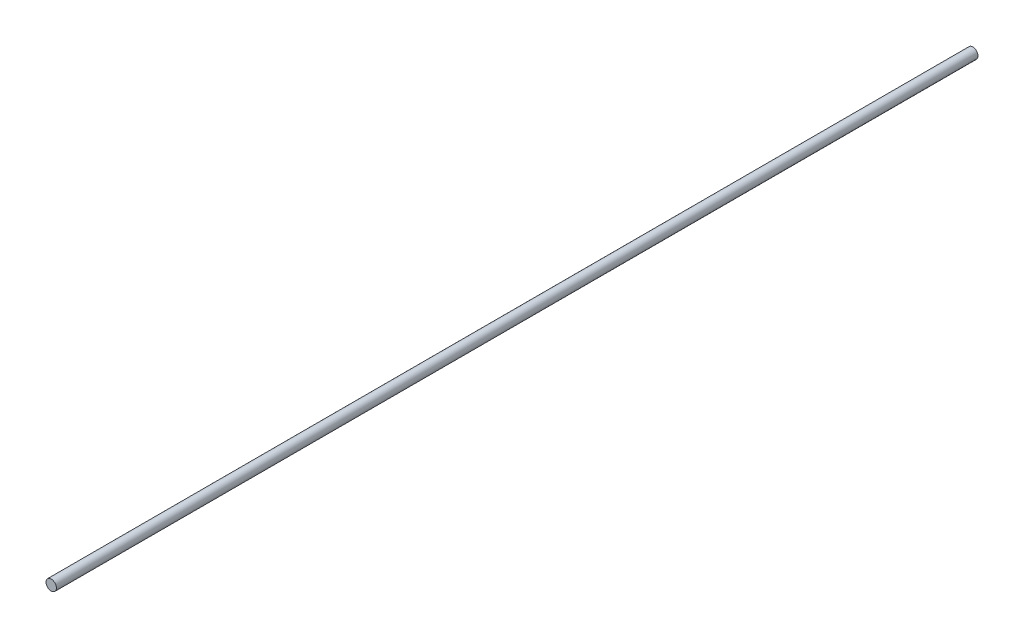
from build123d import *

# Parameters (mm, degrees)
SKETCH1_R           = 30
BOSS_EXTRUDE1_DEPTH = 5300


with BuildPart() as part:
    # Sketch1 → Boss-Extrude1 (new body)
    with BuildSketch(Plane.XY):
        Circle(SKETCH1_R)
    extrude(amount=-BOSS_EXTRUDE1_DEPTH)


solid = part.part
